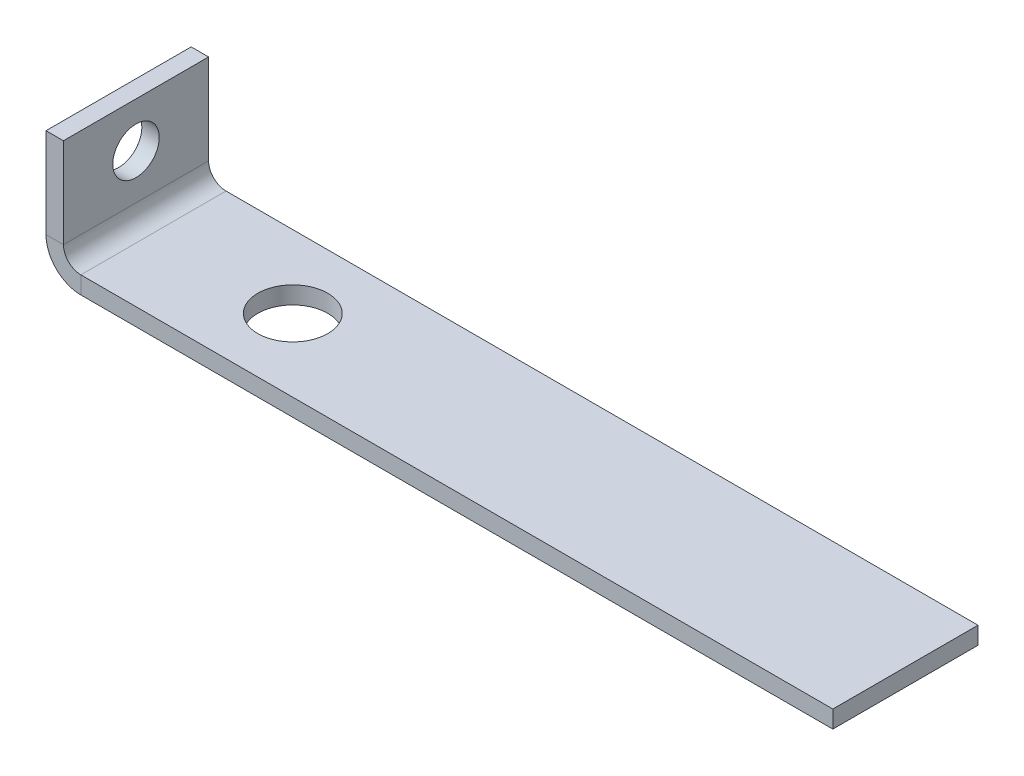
ISO-10303-21;
HEADER;
FILE_DESCRIPTION(('STEP AP214'),'2;1');
FILE_NAME('part.step','',(''),(''),'','','');
FILE_SCHEMA(('AUTOMOTIVE_DESIGN { 1 0 10303 214 1 1 1 1 }'));
ENDSEC;
DATA;
#1=APPLICATION_CONTEXT('core data for automotive mechanical design processes');
#2=APPLICATION_PROTOCOL_DEFINITION('international standard','automotive_design',2000,#1);
#3=PRODUCT_CONTEXT('',#1,'mechanical');
#4=PRODUCT('Part','Part','',(#3));
#5=PRODUCT_RELATED_PRODUCT_CATEGORY('part','',(#4));
#6=PRODUCT_DEFINITION_FORMATION('','',#4);
#7=PRODUCT_DEFINITION_CONTEXT('part definition',#1,'design');
#8=PRODUCT_DEFINITION('design','',#6,#7);
#9=PRODUCT_DEFINITION_SHAPE('','',#8);
#10=(LENGTH_UNIT() NAMED_UNIT(*) SI_UNIT(.MILLI.,.METRE.));
#11=(NAMED_UNIT(*) PLANE_ANGLE_UNIT() SI_UNIT($,.RADIAN.));
#12=(NAMED_UNIT(*) SI_UNIT($,.STERADIAN.) SOLID_ANGLE_UNIT());
#13=UNCERTAINTY_MEASURE_WITH_UNIT(LENGTH_MEASURE(1.E-05),#10,'distance_accuracy_value','');
#14=(GEOMETRIC_REPRESENTATION_CONTEXT(3) GLOBAL_UNCERTAINTY_ASSIGNED_CONTEXT((#13)) GLOBAL_UNIT_ASSIGNED_CONTEXT((#10,
#11,#12)) REPRESENTATION_CONTEXT('',''));
#15=CARTESIAN_POINT('',(0.,0.,0.));
#16=DIRECTION('',(0.,0.,1.));
#17=DIRECTION('',(1.,0.,0.));
#18=AXIS2_PLACEMENT_3D('',#15,#16,#17);
#19=CARTESIAN_POINT('',(-3.66697356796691,-0.150000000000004,-1.25));
#20=DIRECTION('',(0.,0.,1.));
#21=DIRECTION('',(0.,-1.,0.));
#22=AXIS2_PLACEMENT_3D('',#19,#20,#21);
#23=PLANE('',#22);
#24=DIRECTION('',(0.,1.,0.));
#25=VECTOR('',#24,1.);
#26=CARTESIAN_POINT('',(-9.85,-0.149999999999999,-1.25));
#27=LINE('',#26,#25);
#28=CARTESIAN_POINT('',(-9.85,0.3,-1.25));
#29=VERTEX_POINT('',#28);
#30=CARTESIAN_POINT('',(-9.85,1.85,-1.25));
#31=VERTEX_POINT('',#30);
#32=EDGE_CURVE('E140',#29,#31,#27,.T.);
#33=ORIENTED_EDGE('',*,*,#32,.T.);
#34=DIRECTION('',(-1.,0.,0.));
#35=VECTOR('',#34,1.);
#36=CARTESIAN_POINT('',(-3.66697356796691,1.85,-1.25));
#37=LINE('',#36,#35);
#38=CARTESIAN_POINT('',(-9.55,1.85,-1.25));
#39=VERTEX_POINT('',#38);
#40=EDGE_CURVE('E159',#39,#31,#37,.T.);
#41=ORIENTED_EDGE('',*,*,#40,.F.);
#42=DIRECTION('',(0.,1.,0.));
#43=VECTOR('',#42,1.);
#44=CARTESIAN_POINT('',(-9.55,-0.149999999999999,-1.25));
#45=LINE('',#44,#43);
#46=CARTESIAN_POINT('',(-9.55,0.3,-1.25));
#47=VERTEX_POINT('',#46);
#48=EDGE_CURVE('E148',#47,#39,#45,.T.);
#49=ORIENTED_EDGE('',*,*,#48,.F.);
#50=DIRECTION('',(-1.,0.,0.));
#51=VECTOR('',#50,1.);
#52=CARTESIAN_POINT('',(-3.66697356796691,0.299999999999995,-1.25));
#53=LINE('',#52,#51);
#54=EDGE_CURVE('E96',#47,#29,#53,.T.);
#55=ORIENTED_EDGE('',*,*,#54,.T.);
#56=EDGE_LOOP('',(#33,#41,#49,#55));
#57=FACE_BOUND('',#56,.T.);
#58=ADVANCED_FACE('F24',(#57),#23,.F.);
#59=CARTESIAN_POINT('',(-3.66697356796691,1.85,1.25));
#60=DIRECTION('',(0.,1.,0.));
#61=DIRECTION('',(-1.,0.,0.));
#62=AXIS2_PLACEMENT_3D('',#59,#60,#61);
#63=PLANE('',#62);
#64=ORIENTED_EDGE('',*,*,#40,.T.);
#65=DIRECTION('',(0.,0.,-1.));
#66=VECTOR('',#65,1.);
#67=CARTESIAN_POINT('',(-9.85,1.85,1.25));
#68=LINE('',#67,#66);
#69=CARTESIAN_POINT('',(-9.85,1.85,1.25));
#70=VERTEX_POINT('',#69);
#71=EDGE_CURVE('E143',#70,#31,#68,.T.);
#72=ORIENTED_EDGE('',*,*,#71,.F.);
#73=DIRECTION('',(-1.,0.,0.));
#74=VECTOR('',#73,1.);
#75=CARTESIAN_POINT('',(-3.66697356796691,1.85,1.25));
#76=LINE('',#75,#74);
#77=CARTESIAN_POINT('',(-9.55,1.85,1.25));
#78=VERTEX_POINT('',#77);
#79=EDGE_CURVE('E157',#78,#70,#76,.T.);
#80=ORIENTED_EDGE('',*,*,#79,.F.);
#81=DIRECTION('',(0.,0.,-1.));
#82=VECTOR('',#81,1.);
#83=CARTESIAN_POINT('',(-9.55,1.85,1.25));
#84=LINE('',#83,#82);
#85=EDGE_CURVE('E38',#78,#39,#84,.T.);
#86=ORIENTED_EDGE('',*,*,#85,.T.);
#87=EDGE_LOOP('',(#64,#72,#80,#86));
#88=FACE_BOUND('',#87,.T.);
#89=ADVANCED_FACE('F166',(#88),#63,.T.);
#90=CARTESIAN_POINT('',(-3.66697356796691,-0.150000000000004,1.25));
#91=DIRECTION('',(0.,0.,1.));
#92=DIRECTION('',(0.,-1.,0.));
#93=AXIS2_PLACEMENT_3D('',#90,#91,#92);
#94=PLANE('',#93);
#95=ORIENTED_EDGE('',*,*,#79,.T.);
#96=DIRECTION('',(0.,-1.,0.));
#97=VECTOR('',#96,1.);
#98=CARTESIAN_POINT('',(-9.85,-0.149999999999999,1.25));
#99=LINE('',#98,#97);
#100=CARTESIAN_POINT('',(-9.85,0.299999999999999,1.24999999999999));
#101=VERTEX_POINT('',#100);
#102=EDGE_CURVE('E11',#70,#101,#99,.T.);
#103=ORIENTED_EDGE('',*,*,#102,.T.);
#104=DIRECTION('',(-1.,0.,0.));
#105=VECTOR('',#104,1.);
#106=CARTESIAN_POINT('',(-3.66697356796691,0.299999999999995,1.25));
#107=LINE('',#106,#105);
#108=CARTESIAN_POINT('',(-9.55,0.299999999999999,1.24999999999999));
#109=VERTEX_POINT('',#108);
#110=EDGE_CURVE('E155',#109,#101,#107,.T.);
#111=ORIENTED_EDGE('',*,*,#110,.F.);
#112=DIRECTION('',(0.,-1.,0.));
#113=VECTOR('',#112,1.);
#114=CARTESIAN_POINT('',(-9.55,-0.149999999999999,1.25));
#115=LINE('',#114,#113);
#116=EDGE_CURVE('E31',#78,#109,#115,.T.);
#117=ORIENTED_EDGE('',*,*,#116,.F.);
#118=EDGE_LOOP('',(#95,#103,#111,#117));
#119=FACE_BOUND('',#118,.T.);
#120=ADVANCED_FACE('F168',(#119),#94,.T.);
#121=CARTESIAN_POINT('',(-9.55,-0.149999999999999,1.25));
#122=DIRECTION('',(-1.,0.,0.));
#123=DIRECTION('',(0.,-1.,0.));
#124=AXIS2_PLACEMENT_3D('',#121,#122,#123);
#125=PLANE('',#124);
#126=CARTESIAN_POINT('',(-9.55,1.075,0.));
#127=DIRECTION('',(1.,0.,0.));
#128=DIRECTION('',(0.,1.,0.));
#129=AXIS2_PLACEMENT_3D('',#126,#127,#128);
#130=CIRCLE('',#129,0.4);
#131=CARTESIAN_POINT('',(-9.55,1.475,0.));
#132=VERTEX_POINT('',#131);
#133=EDGE_CURVE('E127',#132,#132,#130,.T.);
#134=ORIENTED_EDGE('',*,*,#133,.F.);
#135=EDGE_LOOP('',(#134));
#136=FACE_BOUND('',#135,.T.);
#137=ORIENTED_EDGE('',*,*,#116,.T.);
#138=DIRECTION('',(0.,0.,-1.));
#139=VECTOR('',#138,1.);
#140=CARTESIAN_POINT('',(-9.55,0.3,-1.25));
#141=LINE('',#140,#139);
#142=EDGE_CURVE('E152',#109,#47,#141,.T.);
#143=ORIENTED_EDGE('',*,*,#142,.T.);
#144=ORIENTED_EDGE('',*,*,#48,.T.);
#145=ORIENTED_EDGE('',*,*,#85,.F.);
#146=EDGE_LOOP('',(#137,#143,#144,#145));
#147=FACE_BOUND('',#146,.T.);
#148=ADVANCED_FACE('F162',(#136,#147),#125,.F.);
#149=CARTESIAN_POINT('',(-9.85,-0.149999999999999,1.25));
#150=DIRECTION('',(-1.,0.,0.));
#151=DIRECTION('',(0.,-1.,0.));
#152=AXIS2_PLACEMENT_3D('',#149,#150,#151);
#153=PLANE('',#152);
#154=CARTESIAN_POINT('',(-9.85,1.075,0.));
#155=DIRECTION('',(1.,0.,0.));
#156=DIRECTION('',(0.,1.,0.));
#157=AXIS2_PLACEMENT_3D('',#154,#155,#156);
#158=CIRCLE('',#157,0.4);
#159=CARTESIAN_POINT('',(-9.85,1.475,0.));
#160=VERTEX_POINT('',#159);
#161=EDGE_CURVE('E131',#160,#160,#158,.T.);
#162=ORIENTED_EDGE('',*,*,#161,.T.);
#163=EDGE_LOOP('',(#162));
#164=FACE_BOUND('',#163,.T.);
#165=DIRECTION('',(0.,0.,-1.));
#166=VECTOR('',#165,1.);
#167=CARTESIAN_POINT('',(-9.85,0.3,-1.25));
#168=LINE('',#167,#166);
#169=EDGE_CURVE('E145',#101,#29,#168,.T.);
#170=ORIENTED_EDGE('',*,*,#169,.F.);
#171=ORIENTED_EDGE('',*,*,#102,.F.);
#172=ORIENTED_EDGE('',*,*,#71,.T.);
#173=ORIENTED_EDGE('',*,*,#32,.F.);
#174=EDGE_LOOP('',(#170,#171,#172,#173));
#175=FACE_BOUND('',#174,.T.);
#176=ADVANCED_FACE('F170',(#164,#175),#153,.T.);
#177=CARTESIAN_POINT('',(-9.85,1.075,0.));
#178=DIRECTION('',(1.,0.,0.));
#179=DIRECTION('',(0.,1.,0.));
#180=AXIS2_PLACEMENT_3D('',#177,#178,#179);
#181=CYLINDRICAL_SURFACE('',#180,0.4);
#182=ORIENTED_EDGE('',*,*,#161,.F.);
#183=EDGE_LOOP('',(#182));
#184=FACE_BOUND('',#183,.T.);
#185=ORIENTED_EDGE('',*,*,#133,.T.);
#186=EDGE_LOOP('',(#185));
#187=FACE_BOUND('',#186,.T.);
#188=ADVANCED_FACE('F207',(#184,#187),#181,.F.);
#189=CARTESIAN_POINT('',(3.7,-0.3,1.25));
#190=DIRECTION('',(0.,-1.,0.));
#191=DIRECTION('',(0.,0.,-1.));
#192=AXIS2_PLACEMENT_3D('',#189,#190,#191);
#193=PLANE('',#192);
#194=CARTESIAN_POINT('',(-6.85,-0.3,0.));
#195=DIRECTION('',(0.,1.,0.));
#196=DIRECTION('',(0.,0.,1.));
#197=AXIS2_PLACEMENT_3D('',#194,#195,#196);
#198=CIRCLE('',#197,0.602421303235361);
#199=CARTESIAN_POINT('',(-6.85,-0.3,0.602421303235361));
#200=VERTEX_POINT('',#199);
#201=EDGE_CURVE('E187',#200,#200,#198,.T.);
#202=ORIENTED_EDGE('',*,*,#201,.T.);
#203=EDGE_LOOP('',(#202));
#204=FACE_BOUND('',#203,.T.);
#205=DIRECTION('',(1.,0.,0.));
#206=VECTOR('',#205,1.);
#207=CARTESIAN_POINT('',(3.7,-0.3,1.25));
#208=LINE('',#207,#206);
#209=CARTESIAN_POINT('',(3.7,-0.3,1.25));
#210=VERTEX_POINT('',#209);
#211=CARTESIAN_POINT('',(-9.25,-0.299999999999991,1.25));
#212=VERTEX_POINT('',#211);
#213=EDGE_CURVE('E110',#210,#212,#208,.F.);
#214=ORIENTED_EDGE('',*,*,#213,.T.);
#215=DIRECTION('',(0.,0.,-1.));
#216=VECTOR('',#215,1.);
#217=CARTESIAN_POINT('',(-9.25,-0.299999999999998,-1.25));
#218=LINE('',#217,#216);
#219=CARTESIAN_POINT('',(-9.25,-0.3,-1.25));
#220=VERTEX_POINT('',#219);
#221=EDGE_CURVE('E109',#212,#220,#218,.T.);
#222=ORIENTED_EDGE('',*,*,#221,.T.);
#223=DIRECTION('',(1.,0.,0.));
#224=VECTOR('',#223,1.);
#225=CARTESIAN_POINT('',(3.7,-0.3,-1.25));
#226=LINE('',#225,#224);
#227=CARTESIAN_POINT('',(3.7,-0.299999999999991,-1.25));
#228=VERTEX_POINT('',#227);
#229=EDGE_CURVE('E126',#228,#220,#226,.F.);
#230=ORIENTED_EDGE('',*,*,#229,.F.);
#231=DIRECTION('',(0.,0.,-1.));
#232=VECTOR('',#231,1.);
#233=CARTESIAN_POINT('',(3.7,-0.3,1.25));
#234=LINE('',#233,#232);
#235=EDGE_CURVE('E191',#210,#228,#234,.T.);
#236=ORIENTED_EDGE('',*,*,#235,.F.);
#237=EDGE_LOOP('',(#214,#222,#230,#236));
#238=FACE_BOUND('',#237,.T.);
#239=ADVANCED_FACE('F205',(#204,#238),#193,.T.);
#240=CARTESIAN_POINT('',(3.7,0.,1.25));
#241=DIRECTION('',(0.,-1.,0.));
#242=DIRECTION('',(0.,0.,-1.));
#243=AXIS2_PLACEMENT_3D('',#240,#241,#242);
#244=PLANE('',#243);
#245=CARTESIAN_POINT('',(-6.85,0.,0.));
#246=DIRECTION('',(0.,1.,0.));
#247=DIRECTION('',(0.,0.,1.));
#248=AXIS2_PLACEMENT_3D('',#245,#246,#247);
#249=CIRCLE('',#248,0.602421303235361);
#250=CARTESIAN_POINT('',(-6.85,0.,0.602421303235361));
#251=VERTEX_POINT('',#250);
#252=EDGE_CURVE('E121',#251,#251,#249,.T.);
#253=ORIENTED_EDGE('',*,*,#252,.F.);
#254=EDGE_LOOP('',(#253));
#255=FACE_BOUND('',#254,.T.);
#256=DIRECTION('',(0.,0.,-1.));
#257=VECTOR('',#256,1.);
#258=CARTESIAN_POINT('',(-9.25,0.,-1.25));
#259=LINE('',#258,#257);
#260=CARTESIAN_POINT('',(-9.25,0.,1.24999999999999));
#261=VERTEX_POINT('',#260);
#262=CARTESIAN_POINT('',(-9.25,0.,-1.25));
#263=VERTEX_POINT('',#262);
#264=EDGE_CURVE('E103',#261,#263,#259,.T.);
#265=ORIENTED_EDGE('',*,*,#264,.F.);
#266=DIRECTION('',(1.,0.,0.));
#267=VECTOR('',#266,1.);
#268=CARTESIAN_POINT('',(3.7,0.,1.25));
#269=LINE('',#268,#267);
#270=CARTESIAN_POINT('',(3.7,0.,1.25));
#271=VERTEX_POINT('',#270);
#272=EDGE_CURVE('E120',#271,#261,#269,.F.);
#273=ORIENTED_EDGE('',*,*,#272,.F.);
#274=DIRECTION('',(0.,0.,-1.));
#275=VECTOR('',#274,1.);
#276=CARTESIAN_POINT('',(3.7,0.,1.25));
#277=LINE('',#276,#275);
#278=CARTESIAN_POINT('',(3.7,0.,-1.25));
#279=VERTEX_POINT('',#278);
#280=EDGE_CURVE('E116',#271,#279,#277,.T.);
#281=ORIENTED_EDGE('',*,*,#280,.T.);
#282=DIRECTION('',(1.,0.,0.));
#283=VECTOR('',#282,1.);
#284=CARTESIAN_POINT('',(3.7,0.,-1.25));
#285=LINE('',#284,#283);
#286=EDGE_CURVE('E113',#279,#263,#285,.F.);
#287=ORIENTED_EDGE('',*,*,#286,.T.);
#288=EDGE_LOOP('',(#265,#273,#281,#287));
#289=FACE_BOUND('',#288,.T.);
#290=ADVANCED_FACE('F114',(#255,#289),#244,.F.);
#291=CARTESIAN_POINT('',(-6.85,-0.3,0.));
#292=DIRECTION('',(0.,1.,0.));
#293=DIRECTION('',(0.,0.,1.));
#294=AXIS2_PLACEMENT_3D('',#291,#292,#293);
#295=CYLINDRICAL_SURFACE('',#294,0.602421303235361);
#296=ORIENTED_EDGE('',*,*,#201,.F.);
#297=EDGE_LOOP('',(#296));
#298=FACE_BOUND('',#297,.T.);
#299=ORIENTED_EDGE('',*,*,#252,.T.);
#300=EDGE_LOOP('',(#299));
#301=FACE_BOUND('',#300,.T.);
#302=ADVANCED_FACE('F214',(#298,#301),#295,.F.);
#303=CARTESIAN_POINT('',(3.7,26.3782107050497,-1.25));
#304=DIRECTION('',(0.,0.,1.));
#305=DIRECTION('',(1.,0.,0.));
#306=AXIS2_PLACEMENT_3D('',#303,#304,#305);
#307=PLANE('',#306);
#308=ORIENTED_EDGE('',*,*,#229,.T.);
#309=DIRECTION('',(0.,-1.,0.));
#310=VECTOR('',#309,1.);
#311=CARTESIAN_POINT('',(-9.25,26.3782107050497,-1.25));
#312=LINE('',#311,#310);
#313=EDGE_CURVE('E93',#263,#220,#312,.T.);
#314=ORIENTED_EDGE('',*,*,#313,.F.);
#315=ORIENTED_EDGE('',*,*,#286,.F.);
#316=DIRECTION('',(0.,-1.,0.));
#317=VECTOR('',#316,1.);
#318=CARTESIAN_POINT('',(3.7,26.3782107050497,-1.25));
#319=LINE('',#318,#317);
#320=EDGE_CURVE('E196',#279,#228,#319,.T.);
#321=ORIENTED_EDGE('',*,*,#320,.T.);
#322=EDGE_LOOP('',(#308,#314,#315,#321));
#323=FACE_BOUND('',#322,.T.);
#324=ADVANCED_FACE('F124',(#323),#307,.F.);
#325=CARTESIAN_POINT('',(3.7,26.3782107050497,1.25));
#326=DIRECTION('',(0.,0.,1.));
#327=DIRECTION('',(1.,0.,0.));
#328=AXIS2_PLACEMENT_3D('',#325,#326,#327);
#329=PLANE('',#328);
#330=DIRECTION('',(0.,-1.,0.));
#331=VECTOR('',#330,1.);
#332=CARTESIAN_POINT('',(-9.25,26.3782107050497,1.25));
#333=LINE('',#332,#331);
#334=EDGE_CURVE('E128',#261,#212,#333,.T.);
#335=ORIENTED_EDGE('',*,*,#334,.T.);
#336=ORIENTED_EDGE('',*,*,#213,.F.);
#337=DIRECTION('',(0.,-1.,0.));
#338=VECTOR('',#337,1.);
#339=CARTESIAN_POINT('',(3.7,26.3782107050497,1.25));
#340=LINE('',#339,#338);
#341=EDGE_CURVE('E134',#271,#210,#340,.T.);
#342=ORIENTED_EDGE('',*,*,#341,.F.);
#343=ORIENTED_EDGE('',*,*,#272,.T.);
#344=EDGE_LOOP('',(#335,#336,#342,#343));
#345=FACE_BOUND('',#344,.T.);
#346=ADVANCED_FACE('F203',(#345),#329,.T.);
#347=CARTESIAN_POINT('',(3.7,26.3782107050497,1.25));
#348=DIRECTION('',(-1.,0.,0.));
#349=DIRECTION('',(0.,0.,1.));
#350=AXIS2_PLACEMENT_3D('',#347,#348,#349);
#351=PLANE('',#350);
#352=ORIENTED_EDGE('',*,*,#235,.T.);
#353=ORIENTED_EDGE('',*,*,#320,.F.);
#354=ORIENTED_EDGE('',*,*,#280,.F.);
#355=ORIENTED_EDGE('',*,*,#341,.T.);
#356=EDGE_LOOP('',(#352,#353,#354,#355));
#357=FACE_BOUND('',#356,.T.);
#358=ADVANCED_FACE('F200',(#357),#351,.F.);
#359=CARTESIAN_POINT('',(-9.25,0.3,-1.25));
#360=DIRECTION('',(0.,0.,-1.));
#361=DIRECTION('',(-1.,0.,0.));
#362=AXIS2_PLACEMENT_3D('',#359,#360,#361);
#363=PLANE('',#362);
#364=ORIENTED_EDGE('',*,*,#54,.F.);
#365=CARTESIAN_POINT('',(-9.25,0.3,-1.25));
#366=DIRECTION('',(0.,0.,1.));
#367=DIRECTION('',(1.,0.,0.));
#368=AXIS2_PLACEMENT_3D('',#365,#366,#367);
#369=CIRCLE('',#368,0.3);
#370=EDGE_CURVE('E89',#47,#263,#369,.T.);
#371=ORIENTED_EDGE('',*,*,#370,.T.);
#372=ORIENTED_EDGE('',*,*,#313,.T.);
#373=CARTESIAN_POINT('',(-9.25,0.3,-1.25));
#374=DIRECTION('',(0.,0.,1.));
#375=DIRECTION('',(1.,0.,0.));
#376=AXIS2_PLACEMENT_3D('',#373,#374,#375);
#377=CIRCLE('',#376,0.6);
#378=EDGE_CURVE('E175',#29,#220,#377,.T.);
#379=ORIENTED_EDGE('',*,*,#378,.F.);
#380=EDGE_LOOP('',(#364,#371,#372,#379));
#381=FACE_BOUND('',#380,.T.);
#382=ADVANCED_FACE('F91',(#381),#363,.T.);
#383=CARTESIAN_POINT('',(-9.25,0.3,1.25));
#384=DIRECTION('',(0.,0.,1.));
#385=DIRECTION('',(1.,0.,0.));
#386=AXIS2_PLACEMENT_3D('',#383,#384,#385);
#387=PLANE('',#386);
#388=CARTESIAN_POINT('',(-9.25,0.3,1.24999999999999));
#389=DIRECTION('',(0.,0.,1.));
#390=DIRECTION('',(1.,0.,0.));
#391=AXIS2_PLACEMENT_3D('',#388,#389,#390);
#392=CIRCLE('',#391,0.3);
#393=EDGE_CURVE('E99',#261,#109,#392,.F.);
#394=ORIENTED_EDGE('',*,*,#393,.T.);
#395=ORIENTED_EDGE('',*,*,#110,.T.);
#396=CARTESIAN_POINT('',(-9.25,0.3,1.24999999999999));
#397=DIRECTION('',(0.,0.,1.));
#398=DIRECTION('',(1.,0.,0.));
#399=AXIS2_PLACEMENT_3D('',#396,#397,#398);
#400=CIRCLE('',#399,0.6);
#401=EDGE_CURVE('E177',#212,#101,#400,.F.);
#402=ORIENTED_EDGE('',*,*,#401,.F.);
#403=ORIENTED_EDGE('',*,*,#334,.F.);
#404=EDGE_LOOP('',(#394,#395,#402,#403));
#405=FACE_BOUND('',#404,.T.);
#406=ADVANCED_FACE('F243',(#405),#387,.T.);
#407=CARTESIAN_POINT('',(-9.25,0.3,-16.6639073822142));
#408=DIRECTION('',(0.,0.,1.));
#409=DIRECTION('',(1.,0.,0.));
#410=AXIS2_PLACEMENT_3D('',#407,#408,#409);
#411=CYLINDRICAL_SURFACE('',#410,0.6);
#412=ORIENTED_EDGE('',*,*,#221,.F.);
#413=ORIENTED_EDGE('',*,*,#401,.T.);
#414=ORIENTED_EDGE('',*,*,#169,.T.);
#415=ORIENTED_EDGE('',*,*,#378,.T.);
#416=EDGE_LOOP('',(#412,#413,#414,#415));
#417=FACE_BOUND('',#416,.T.);
#418=ADVANCED_FACE('F174',(#417),#411,.T.);
#419=CARTESIAN_POINT('',(-9.25,0.3,-16.6639073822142));
#420=DIRECTION('',(0.,0.,1.));
#421=DIRECTION('',(1.,0.,0.));
#422=AXIS2_PLACEMENT_3D('',#419,#420,#421);
#423=CYLINDRICAL_SURFACE('',#422,0.3);
#424=ORIENTED_EDGE('',*,*,#264,.T.);
#425=ORIENTED_EDGE('',*,*,#370,.F.);
#426=ORIENTED_EDGE('',*,*,#142,.F.);
#427=ORIENTED_EDGE('',*,*,#393,.F.);
#428=EDGE_LOOP('',(#424,#425,#426,#427));
#429=FACE_BOUND('',#428,.T.);
#430=ADVANCED_FACE('F105',(#429),#423,.F.);
#431=CLOSED_SHELL('',(#58,#89,#120,#148,#176,#188,#239,#290,#302,#324,#346,#358,#382,#406,#418,#430));
#432=MANIFOLD_SOLID_BREP('B2',#431);
#433=ADVANCED_BREP_SHAPE_REPRESENTATION('',(#18,#432),#14);
#434=SHAPE_DEFINITION_REPRESENTATION(#9,#433);
ENDSEC;
END-ISO-10303-21;
